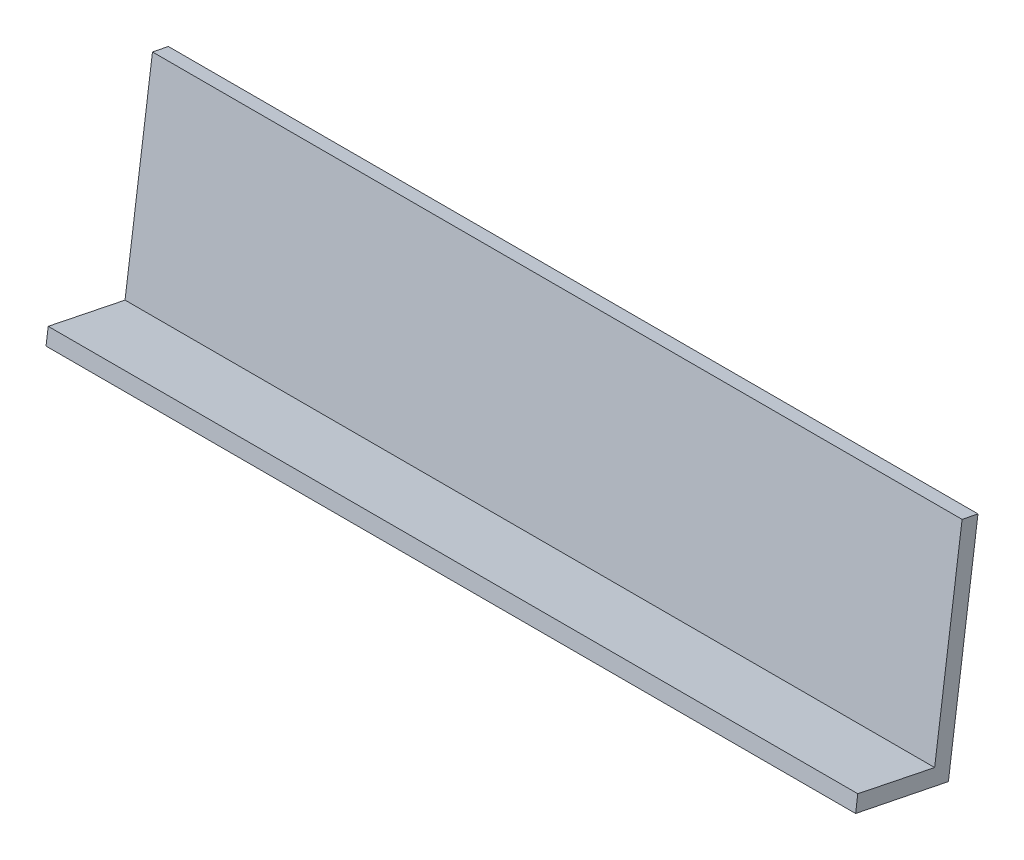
ISO-10303-21;
HEADER;
FILE_DESCRIPTION(('STEP AP214'),'2;1');
FILE_NAME('part.step','',(''),(''),'','','');
FILE_SCHEMA(('AUTOMOTIVE_DESIGN { 1 0 10303 214 1 1 1 1 }'));
ENDSEC;
DATA;
#1=APPLICATION_CONTEXT('core data for automotive mechanical design processes');
#2=APPLICATION_PROTOCOL_DEFINITION('international standard','automotive_design',2000,#1);
#3=PRODUCT_CONTEXT('',#1,'mechanical');
#4=PRODUCT('Part','Part','',(#3));
#5=PRODUCT_RELATED_PRODUCT_CATEGORY('part','',(#4));
#6=PRODUCT_DEFINITION_FORMATION('','',#4);
#7=PRODUCT_DEFINITION_CONTEXT('part definition',#1,'design');
#8=PRODUCT_DEFINITION('design','',#6,#7);
#9=PRODUCT_DEFINITION_SHAPE('','',#8);
#10=(LENGTH_UNIT() NAMED_UNIT(*) SI_UNIT(.MILLI.,.METRE.));
#11=(NAMED_UNIT(*) PLANE_ANGLE_UNIT() SI_UNIT($,.RADIAN.));
#12=(NAMED_UNIT(*) SI_UNIT($,.STERADIAN.) SOLID_ANGLE_UNIT());
#13=UNCERTAINTY_MEASURE_WITH_UNIT(LENGTH_MEASURE(1.E-05),#10,'distance_accuracy_value','');
#14=(GEOMETRIC_REPRESENTATION_CONTEXT(3) GLOBAL_UNCERTAINTY_ASSIGNED_CONTEXT((#13)) GLOBAL_UNIT_ASSIGNED_CONTEXT((#10,
#11,#12)) REPRESENTATION_CONTEXT('',''));
#15=CARTESIAN_POINT('',(0.,0.,0.));
#16=DIRECTION('',(0.,0.,1.));
#17=DIRECTION('',(1.,0.,0.));
#18=AXIS2_PLACEMENT_3D('',#15,#16,#17);
#19=CARTESIAN_POINT('',(600.,-138.347362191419,56.9474027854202));
#20=DIRECTION('',(0.,-0.135208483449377,-0.990817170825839));
#21=DIRECTION('',(0.,0.990817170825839,-0.135208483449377));
#22=AXIS2_PLACEMENT_3D('',#19,#20,#21);
#23=PLANE('',#22);
#24=DIRECTION('',(0.,-0.990817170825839,0.135208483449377));
#25=VECTOR('',#24,1.);
#26=CARTESIAN_POINT('',(0.,-138.347362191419,56.9474027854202));
#27=LINE('',#26,#25);
#28=CARTESIAN_POINT('',(0.,-138.347362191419,56.9474027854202));
#29=VERTEX_POINT('',#28);
#30=CARTESIAN_POINT('',(0.,-150.232482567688,58.5692651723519));
#31=VERTEX_POINT('',#30);
#32=EDGE_CURVE('E116',#29,#31,#27,.T.);
#33=ORIENTED_EDGE('',*,*,#32,.T.);
#34=DIRECTION('',(-1.,0.,0.));
#35=VECTOR('',#34,1.);
#36=CARTESIAN_POINT('',(600.,-150.232482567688,58.5692651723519));
#37=LINE('',#36,#35);
#38=CARTESIAN_POINT('',(600.,-150.232482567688,58.5692651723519));
#39=VERTEX_POINT('',#38);
#40=EDGE_CURVE('E11',#39,#31,#37,.T.);
#41=ORIENTED_EDGE('',*,*,#40,.F.);
#42=DIRECTION('',(0.,-0.990817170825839,0.135208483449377));
#43=VECTOR('',#42,1.);
#44=CARTESIAN_POINT('',(600.,-138.347362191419,56.9474027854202));
#45=LINE('',#44,#43);
#46=CARTESIAN_POINT('',(600.,-138.347362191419,56.9474027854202));
#47=VERTEX_POINT('',#46);
#48=EDGE_CURVE('E80',#47,#39,#45,.T.);
#49=ORIENTED_EDGE('',*,*,#48,.F.);
#50=DIRECTION('',(-1.,0.,0.));
#51=VECTOR('',#50,1.);
#52=CARTESIAN_POINT('',(600.,-138.347362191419,56.9474027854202));
#53=LINE('',#52,#51);
#54=EDGE_CURVE('E49',#47,#29,#53,.T.);
#55=ORIENTED_EDGE('',*,*,#54,.T.);
#56=EDGE_LOOP('',(#33,#41,#49,#55));
#57=FACE_BOUND('',#56,.T.);
#58=ADVANCED_FACE('F33',(#57),#23,.F.);
#59=CARTESIAN_POINT('',(600.,-164.127328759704,-10.1833775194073));
#60=DIRECTION('',(0.,-0.98018300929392,0.198094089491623));
#61=DIRECTION('',(0.,-0.198094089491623,-0.98018300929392));
#62=AXIS2_PLACEMENT_3D('',#59,#60,#61);
#63=PLANE('',#62);
#64=DIRECTION('',(0.,0.198094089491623,0.98018300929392));
#65=VECTOR('',#64,1.);
#66=CARTESIAN_POINT('',(0.,-164.127328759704,-10.1833775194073));
#67=LINE('',#66,#65);
#68=CARTESIAN_POINT('',(0.,-164.127328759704,-10.1833775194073));
#69=VERTEX_POINT('',#68);
#70=EDGE_CURVE('E118',#69,#31,#67,.T.);
#71=ORIENTED_EDGE('',*,*,#70,.F.);
#72=DIRECTION('',(-1.,0.,0.));
#73=VECTOR('',#72,1.);
#74=CARTESIAN_POINT('',(600.,-164.127328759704,-10.1833775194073));
#75=LINE('',#74,#73);
#76=CARTESIAN_POINT('',(600.,-164.127328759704,-10.1833775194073));
#77=VERTEX_POINT('',#76);
#78=EDGE_CURVE('E41',#77,#69,#75,.T.);
#79=ORIENTED_EDGE('',*,*,#78,.F.);
#80=DIRECTION('',(0.,0.198094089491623,0.98018300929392));
#81=VECTOR('',#80,1.);
#82=CARTESIAN_POINT('',(600.,-164.127328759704,-10.1833775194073));
#83=LINE('',#82,#81);
#84=EDGE_CURVE('E140',#77,#39,#83,.T.);
#85=ORIENTED_EDGE('',*,*,#84,.T.);
#86=ORIENTED_EDGE('',*,*,#40,.T.);
#87=EDGE_LOOP('',(#71,#79,#85,#86));
#88=FACE_BOUND('',#87,.T.);
#89=ADVANCED_FACE('F139',(#88),#63,.T.);
#90=CARTESIAN_POINT('',(600.,-164.127328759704,-10.1833775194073));
#91=DIRECTION('',(0.,0.135208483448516,0.990817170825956));
#92=DIRECTION('',(0.,-0.990817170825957,0.135208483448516));
#93=AXIS2_PLACEMENT_3D('',#90,#91,#92);
#94=PLANE('',#93);
#95=DIRECTION('',(0.,0.990817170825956,-0.135208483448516));
#96=VECTOR('',#95,1.);
#97=CARTESIAN_POINT('',(0.,-164.127328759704,-10.1833775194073));
#98=LINE('',#97,#96);
#99=CARTESIAN_POINT('',(0.,-3.28782488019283,-32.1317914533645));
#100=VERTEX_POINT('',#99);
#101=EDGE_CURVE('E121',#69,#100,#98,.T.);
#102=ORIENTED_EDGE('',*,*,#101,.T.);
#103=DIRECTION('',(-1.,0.,0.));
#104=VECTOR('',#103,1.);
#105=CARTESIAN_POINT('',(600.,-3.28782488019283,-32.1317914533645));
#106=LINE('',#105,#104);
#107=CARTESIAN_POINT('',(600.,-3.28782488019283,-32.1317914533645));
#108=VERTEX_POINT('',#107);
#109=EDGE_CURVE('E108',#108,#100,#106,.T.);
#110=ORIENTED_EDGE('',*,*,#109,.F.);
#111=DIRECTION('',(0.,0.990817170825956,-0.135208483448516));
#112=VECTOR('',#111,1.);
#113=CARTESIAN_POINT('',(600.,-164.127328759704,-10.1833775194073));
#114=LINE('',#113,#112);
#115=EDGE_CURVE('E96',#77,#108,#114,.T.);
#116=ORIENTED_EDGE('',*,*,#115,.F.);
#117=ORIENTED_EDGE('',*,*,#78,.T.);
#118=EDGE_LOOP('',(#102,#110,#116,#117));
#119=FACE_BOUND('',#118,.T.);
#120=ADVANCED_FACE('F133',(#119),#94,.F.);
#121=CARTESIAN_POINT('',(600.,-3.28782488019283,-32.1317914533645));
#122=DIRECTION('',(0.,-0.980183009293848,0.198094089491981));
#123=DIRECTION('',(0.,-0.198094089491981,-0.980183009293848));
#124=AXIS2_PLACEMENT_3D('',#121,#122,#123);
#125=PLANE('',#124);
#126=DIRECTION('',(0.,0.198094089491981,0.980183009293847));
#127=VECTOR('',#126,1.);
#128=CARTESIAN_POINT('',(0.,-3.28782488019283,-32.1317914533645));
#129=LINE('',#128,#127);
#130=CARTESIAN_POINT('',(0.,-0.905851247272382,-20.345624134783));
#131=VERTEX_POINT('',#130);
#132=EDGE_CURVE('E105',#100,#131,#129,.T.);
#133=ORIENTED_EDGE('',*,*,#132,.T.);
#134=DIRECTION('',(-1.,0.,0.));
#135=VECTOR('',#134,1.);
#136=CARTESIAN_POINT('',(600.,-0.905851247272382,-20.345624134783));
#137=LINE('',#136,#135);
#138=CARTESIAN_POINT('',(600.,-0.905851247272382,-20.345624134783));
#139=VERTEX_POINT('',#138);
#140=EDGE_CURVE('E102',#139,#131,#137,.T.);
#141=ORIENTED_EDGE('',*,*,#140,.F.);
#142=DIRECTION('',(0.,0.198094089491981,0.980183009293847));
#143=VECTOR('',#142,1.);
#144=CARTESIAN_POINT('',(600.,-3.28782488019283,-32.1317914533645));
#145=LINE('',#144,#143);
#146=EDGE_CURVE('E90',#108,#139,#145,.T.);
#147=ORIENTED_EDGE('',*,*,#146,.F.);
#148=ORIENTED_EDGE('',*,*,#109,.T.);
#149=EDGE_LOOP('',(#133,#141,#147,#148));
#150=FACE_BOUND('',#149,.T.);
#151=ADVANCED_FACE('F103',(#150),#125,.F.);
#152=CARTESIAN_POINT('',(600.,-149.999999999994,0.));
#153=DIRECTION('',(0.,0.135208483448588,0.990817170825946));
#154=DIRECTION('',(0.,-0.990817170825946,0.135208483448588));
#155=AXIS2_PLACEMENT_3D('',#152,#153,#154);
#156=PLANE('',#155);
#157=DIRECTION('',(0.,0.990817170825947,-0.135208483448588));
#158=VECTOR('',#157,1.);
#159=CARTESIAN_POINT('',(0.,-149.999999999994,0.));
#160=LINE('',#159,#158);
#161=CARTESIAN_POINT('',(0.,-149.999999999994,0.));
#162=VERTEX_POINT('',#161);
#163=EDGE_CURVE('E124',#162,#131,#160,.T.);
#164=ORIENTED_EDGE('',*,*,#163,.F.);
#165=DIRECTION('',(-1.,0.,0.));
#166=VECTOR('',#165,1.);
#167=CARTESIAN_POINT('',(600.,-149.999999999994,0.));
#168=LINE('',#167,#166);
#169=CARTESIAN_POINT('',(600.,-149.999999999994,0.));
#170=VERTEX_POINT('',#169);
#171=EDGE_CURVE('E68',#170,#162,#168,.T.);
#172=ORIENTED_EDGE('',*,*,#171,.F.);
#173=DIRECTION('',(0.,0.990817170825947,-0.135208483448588));
#174=VECTOR('',#173,1.);
#175=CARTESIAN_POINT('',(600.,-149.999999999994,0.));
#176=LINE('',#175,#174);
#177=EDGE_CURVE('E94',#170,#139,#176,.T.);
#178=ORIENTED_EDGE('',*,*,#177,.T.);
#179=ORIENTED_EDGE('',*,*,#140,.T.);
#180=EDGE_LOOP('',(#164,#172,#178,#179));
#181=FACE_BOUND('',#180,.T.);
#182=ADVANCED_FACE('F110',(#181),#156,.T.);
#183=CARTESIAN_POINT('',(600.,-138.347362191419,56.9474027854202));
#184=DIRECTION('',(0.,0.979700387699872,-0.200467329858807));
#185=DIRECTION('',(0.,0.200467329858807,0.979700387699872));
#186=AXIS2_PLACEMENT_3D('',#183,#184,#185);
#187=PLANE('',#186);
#188=DIRECTION('',(0.,-0.200467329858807,-0.979700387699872));
#189=VECTOR('',#188,1.);
#190=CARTESIAN_POINT('',(0.,-138.347362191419,56.9474027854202));
#191=LINE('',#190,#189);
#192=EDGE_CURVE('E126',#29,#162,#191,.T.);
#193=ORIENTED_EDGE('',*,*,#192,.F.);
#194=ORIENTED_EDGE('',*,*,#54,.F.);
#195=DIRECTION('',(0.,-0.200467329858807,-0.979700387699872));
#196=VECTOR('',#195,1.);
#197=CARTESIAN_POINT('',(600.,-138.347362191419,56.9474027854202));
#198=LINE('',#197,#196);
#199=EDGE_CURVE('E111',#47,#170,#198,.T.);
#200=ORIENTED_EDGE('',*,*,#199,.T.);
#201=ORIENTED_EDGE('',*,*,#171,.T.);
#202=EDGE_LOOP('',(#193,#194,#200,#201));
#203=FACE_BOUND('',#202,.T.);
#204=ADVANCED_FACE('F141',(#203),#187,.T.);
#205=CARTESIAN_POINT('',(600.,0.,0.));
#206=DIRECTION('',(-1.,0.,0.));
#207=DIRECTION('',(0.,0.,1.));
#208=AXIS2_PLACEMENT_3D('',#205,#206,#207);
#209=PLANE('',#208);
#210=ORIENTED_EDGE('',*,*,#48,.T.);
#211=ORIENTED_EDGE('',*,*,#84,.F.);
#212=ORIENTED_EDGE('',*,*,#115,.T.);
#213=ORIENTED_EDGE('',*,*,#146,.T.);
#214=ORIENTED_EDGE('',*,*,#177,.F.);
#215=ORIENTED_EDGE('',*,*,#199,.F.);
#216=EDGE_LOOP('',(#210,#211,#212,#213,#214,#215));
#217=FACE_BOUND('',#216,.T.);
#218=ADVANCED_FACE('F92',(#217),#209,.F.);
#219=CARTESIAN_POINT('',(0.,0.,0.));
#220=DIRECTION('',(-1.,0.,0.));
#221=DIRECTION('',(0.,0.,1.));
#222=AXIS2_PLACEMENT_3D('',#219,#220,#221);
#223=PLANE('',#222);
#224=ORIENTED_EDGE('',*,*,#32,.F.);
#225=ORIENTED_EDGE('',*,*,#192,.T.);
#226=ORIENTED_EDGE('',*,*,#163,.T.);
#227=ORIENTED_EDGE('',*,*,#132,.F.);
#228=ORIENTED_EDGE('',*,*,#101,.F.);
#229=ORIENTED_EDGE('',*,*,#70,.T.);
#230=EDGE_LOOP('',(#224,#225,#226,#227,#228,#229));
#231=FACE_BOUND('',#230,.T.);
#232=ADVANCED_FACE('F138',(#231),#223,.T.);
#233=CLOSED_SHELL('',(#58,#89,#120,#151,#182,#204,#218,#232));
#234=MANIFOLD_SOLID_BREP('B2',#233);
#235=ADVANCED_BREP_SHAPE_REPRESENTATION('',(#18,#234),#14);
#236=SHAPE_DEFINITION_REPRESENTATION(#9,#235);
ENDSEC;
END-ISO-10303-21;
